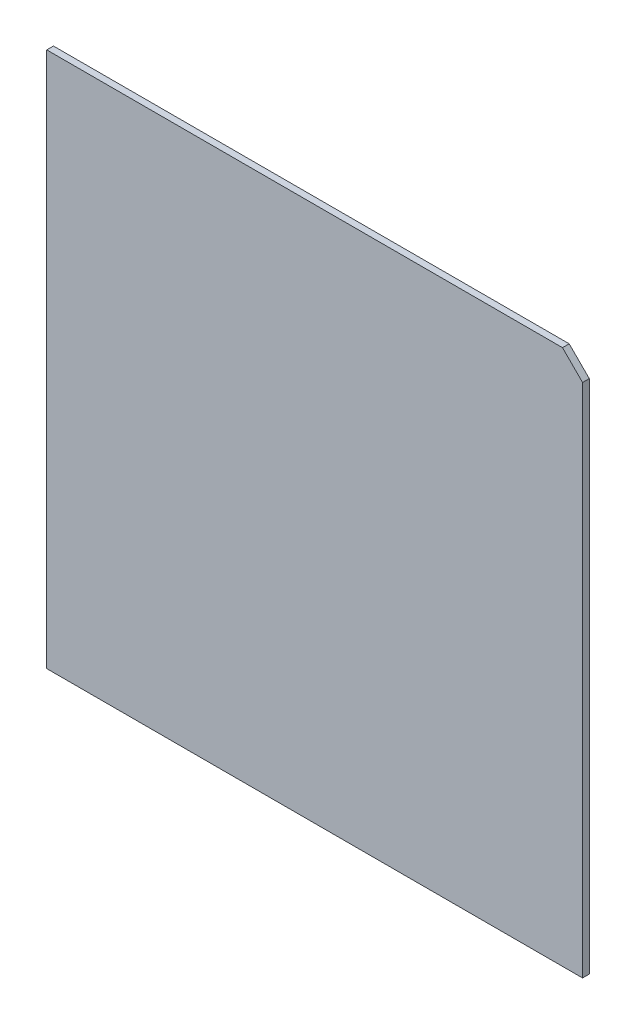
ISO-10303-21;
HEADER;
FILE_DESCRIPTION(('STEP AP214'),'2;1');
FILE_NAME('part.step','',(''),(''),'','','');
FILE_SCHEMA(('AUTOMOTIVE_DESIGN { 1 0 10303 214 1 1 1 1 }'));
ENDSEC;
DATA;
#1=APPLICATION_CONTEXT('core data for automotive mechanical design processes');
#2=APPLICATION_PROTOCOL_DEFINITION('international standard','automotive_design',2000,#1);
#3=PRODUCT_CONTEXT('',#1,'mechanical');
#4=PRODUCT('Part','Part','',(#3));
#5=PRODUCT_RELATED_PRODUCT_CATEGORY('part','',(#4));
#6=PRODUCT_DEFINITION_FORMATION('','',#4);
#7=PRODUCT_DEFINITION_CONTEXT('part definition',#1,'design');
#8=PRODUCT_DEFINITION('design','',#6,#7);
#9=PRODUCT_DEFINITION_SHAPE('','',#8);
#10=(LENGTH_UNIT() NAMED_UNIT(*) SI_UNIT(.MILLI.,.METRE.));
#11=(NAMED_UNIT(*) PLANE_ANGLE_UNIT() SI_UNIT($,.RADIAN.));
#12=(NAMED_UNIT(*) SI_UNIT($,.STERADIAN.) SOLID_ANGLE_UNIT());
#13=UNCERTAINTY_MEASURE_WITH_UNIT(LENGTH_MEASURE(1.E-05),#10,'distance_accuracy_value','');
#14=(GEOMETRIC_REPRESENTATION_CONTEXT(3) GLOBAL_UNCERTAINTY_ASSIGNED_CONTEXT((#13)) GLOBAL_UNIT_ASSIGNED_CONTEXT((#10,
#11,#12)) REPRESENTATION_CONTEXT('',''));
#15=CARTESIAN_POINT('',(0.,0.,0.));
#16=DIRECTION('',(0.,0.,1.));
#17=DIRECTION('',(1.,0.,0.));
#18=AXIS2_PLACEMENT_3D('',#15,#16,#17);
#19=CARTESIAN_POINT('',(-1000.,1000.,25.));
#20=DIRECTION('',(1.,0.,0.));
#21=DIRECTION('',(0.,1.,0.));
#22=AXIS2_PLACEMENT_3D('',#19,#20,#21);
#23=PLANE('',#22);
#24=DIRECTION('',(0.,-1.,0.));
#25=VECTOR('',#24,1.);
#26=CARTESIAN_POINT('',(-1000.,1000.,0.));
#27=LINE('',#26,#25);
#28=CARTESIAN_POINT('',(-1000.,1000.,0.));
#29=VERTEX_POINT('',#28);
#30=CARTESIAN_POINT('',(-1000.,-1000.,0.));
#31=VERTEX_POINT('',#30);
#32=EDGE_CURVE('E108',#29,#31,#27,.T.);
#33=ORIENTED_EDGE('',*,*,#32,.T.);
#34=DIRECTION('',(0.,0.,-1.));
#35=VECTOR('',#34,1.);
#36=CARTESIAN_POINT('',(-1000.,-1000.,25.));
#37=LINE('',#36,#35);
#38=CARTESIAN_POINT('',(-1000.,-1000.,25.));
#39=VERTEX_POINT('',#38);
#40=EDGE_CURVE('E11',#39,#31,#37,.T.);
#41=ORIENTED_EDGE('',*,*,#40,.F.);
#42=DIRECTION('',(0.,-1.,0.));
#43=VECTOR('',#42,1.);
#44=CARTESIAN_POINT('',(-1000.,1000.,25.));
#45=LINE('',#44,#43);
#46=CARTESIAN_POINT('',(-1000.,1000.,25.));
#47=VERTEX_POINT('',#46);
#48=EDGE_CURVE('E110',#47,#39,#45,.T.);
#49=ORIENTED_EDGE('',*,*,#48,.F.);
#50=DIRECTION('',(0.,0.,-1.));
#51=VECTOR('',#50,1.);
#52=CARTESIAN_POINT('',(-1000.,1000.,25.));
#53=LINE('',#52,#51);
#54=EDGE_CURVE('E120',#47,#29,#53,.T.);
#55=ORIENTED_EDGE('',*,*,#54,.T.);
#56=EDGE_LOOP('',(#33,#41,#49,#55));
#57=FACE_BOUND('',#56,.T.);
#58=ADVANCED_FACE('F39',(#57),#23,.F.);
#59=CARTESIAN_POINT('',(-1000.,-1000.,25.));
#60=DIRECTION('',(0.,1.,0.));
#61=DIRECTION('',(-1.,0.,0.));
#62=AXIS2_PLACEMENT_3D('',#59,#60,#61);
#63=PLANE('',#62);
#64=DIRECTION('',(1.,0.,0.));
#65=VECTOR('',#64,1.);
#66=CARTESIAN_POINT('',(-1000.,-1000.,0.));
#67=LINE('',#66,#65);
#68=CARTESIAN_POINT('',(1000.,-1000.,0.));
#69=VERTEX_POINT('',#68);
#70=EDGE_CURVE('E116',#31,#69,#67,.T.);
#71=ORIENTED_EDGE('',*,*,#70,.T.);
#72=DIRECTION('',(0.,0.,-1.));
#73=VECTOR('',#72,1.);
#74=CARTESIAN_POINT('',(1000.,-1000.,25.));
#75=LINE('',#74,#73);
#76=CARTESIAN_POINT('',(1000.,-1000.,25.));
#77=VERTEX_POINT('',#76);
#78=EDGE_CURVE('E47',#77,#69,#75,.T.);
#79=ORIENTED_EDGE('',*,*,#78,.F.);
#80=DIRECTION('',(1.,0.,0.));
#81=VECTOR('',#80,1.);
#82=CARTESIAN_POINT('',(-1000.,-1000.,25.));
#83=LINE('',#82,#81);
#84=EDGE_CURVE('E86',#39,#77,#83,.T.);
#85=ORIENTED_EDGE('',*,*,#84,.F.);
#86=ORIENTED_EDGE('',*,*,#40,.T.);
#87=EDGE_LOOP('',(#71,#79,#85,#86));
#88=FACE_BOUND('',#87,.T.);
#89=ADVANCED_FACE('F131',(#88),#63,.F.);
#90=CARTESIAN_POINT('',(1000.,1000.,25.));
#91=DIRECTION('',(-1.,0.,0.));
#92=DIRECTION('',(0.,-1.,0.));
#93=AXIS2_PLACEMENT_3D('',#90,#91,#92);
#94=PLANE('',#93);
#95=DIRECTION('',(0.,1.,0.));
#96=VECTOR('',#95,1.);
#97=CARTESIAN_POINT('',(1000.,1000.,0.));
#98=LINE('',#97,#96);
#99=CARTESIAN_POINT('',(1000.,925.,0.));
#100=VERTEX_POINT('',#99);
#101=EDGE_CURVE('E111',#69,#100,#98,.T.);
#102=ORIENTED_EDGE('',*,*,#101,.T.);
#103=DIRECTION('',(0.,0.,1.));
#104=VECTOR('',#103,1.);
#105=CARTESIAN_POINT('',(1000.,925.,0.));
#106=LINE('',#105,#104);
#107=CARTESIAN_POINT('',(1000.,925.,25.));
#108=VERTEX_POINT('',#107);
#109=EDGE_CURVE('E54',#100,#108,#106,.T.);
#110=ORIENTED_EDGE('',*,*,#109,.T.);
#111=DIRECTION('',(0.,1.,0.));
#112=VECTOR('',#111,1.);
#113=CARTESIAN_POINT('',(1000.,1000.,25.));
#114=LINE('',#113,#112);
#115=EDGE_CURVE('E128',#77,#108,#114,.T.);
#116=ORIENTED_EDGE('',*,*,#115,.F.);
#117=ORIENTED_EDGE('',*,*,#78,.T.);
#118=EDGE_LOOP('',(#102,#110,#116,#117));
#119=FACE_BOUND('',#118,.T.);
#120=ADVANCED_FACE('F126',(#119),#94,.F.);
#121=CARTESIAN_POINT('',(-1000.,1000.,25.));
#122=DIRECTION('',(0.,-1.,0.));
#123=DIRECTION('',(0.,0.,-1.));
#124=AXIS2_PLACEMENT_3D('',#121,#122,#123);
#125=PLANE('',#124);
#126=DIRECTION('',(-1.,0.,0.));
#127=VECTOR('',#126,1.);
#128=CARTESIAN_POINT('',(-1000.,1000.,25.));
#129=LINE('',#128,#127);
#130=CARTESIAN_POINT('',(925.,1000.,25.));
#131=VERTEX_POINT('',#130);
#132=EDGE_CURVE('E63',#131,#47,#129,.T.);
#133=ORIENTED_EDGE('',*,*,#132,.F.);
#134=DIRECTION('',(0.,0.,1.));
#135=VECTOR('',#134,1.);
#136=CARTESIAN_POINT('',(925.,1000.,0.));
#137=LINE('',#136,#135);
#138=CARTESIAN_POINT('',(925.,1000.,0.));
#139=VERTEX_POINT('',#138);
#140=EDGE_CURVE('E95',#139,#131,#137,.T.);
#141=ORIENTED_EDGE('',*,*,#140,.F.);
#142=DIRECTION('',(-1.,0.,0.));
#143=VECTOR('',#142,1.);
#144=CARTESIAN_POINT('',(-1000.,1000.,0.));
#145=LINE('',#144,#143);
#146=EDGE_CURVE('E81',#139,#29,#145,.T.);
#147=ORIENTED_EDGE('',*,*,#146,.T.);
#148=ORIENTED_EDGE('',*,*,#54,.F.);
#149=EDGE_LOOP('',(#133,#141,#147,#148));
#150=FACE_BOUND('',#149,.T.);
#151=ADVANCED_FACE('F102',(#150),#125,.F.);
#152=CARTESIAN_POINT('',(0.,0.,25.));
#153=DIRECTION('',(0.,0.,1.));
#154=DIRECTION('',(1.,0.,0.));
#155=AXIS2_PLACEMENT_3D('',#152,#153,#154);
#156=PLANE('',#155);
#157=DIRECTION('',(0.707106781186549,-0.707106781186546,0.));
#158=VECTOR('',#157,1.);
#159=CARTESIAN_POINT('',(925.,1000.,25.));
#160=LINE('',#159,#158);
#161=EDGE_CURVE('E100',#131,#108,#160,.T.);
#162=ORIENTED_EDGE('',*,*,#161,.F.);
#163=ORIENTED_EDGE('',*,*,#132,.T.);
#164=ORIENTED_EDGE('',*,*,#48,.T.);
#165=ORIENTED_EDGE('',*,*,#84,.T.);
#166=ORIENTED_EDGE('',*,*,#115,.T.);
#167=EDGE_LOOP('',(#162,#163,#164,#165,#166));
#168=FACE_BOUND('',#167,.T.);
#169=ADVANCED_FACE('F146',(#168),#156,.T.);
#170=CARTESIAN_POINT('',(0.,0.,0.));
#171=DIRECTION('',(0.,0.,1.));
#172=DIRECTION('',(1.,0.,0.));
#173=AXIS2_PLACEMENT_3D('',#170,#171,#172);
#174=PLANE('',#173);
#175=ORIENTED_EDGE('',*,*,#146,.F.);
#176=DIRECTION('',(0.707106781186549,-0.707106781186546,0.));
#177=VECTOR('',#176,1.);
#178=CARTESIAN_POINT('',(925.,1000.,0.));
#179=LINE('',#178,#177);
#180=EDGE_CURVE('E93',#139,#100,#179,.T.);
#181=ORIENTED_EDGE('',*,*,#180,.T.);
#182=ORIENTED_EDGE('',*,*,#101,.F.);
#183=ORIENTED_EDGE('',*,*,#70,.F.);
#184=ORIENTED_EDGE('',*,*,#32,.F.);
#185=EDGE_LOOP('',(#175,#181,#182,#183,#184));
#186=FACE_BOUND('',#185,.T.);
#187=ADVANCED_FACE('F106',(#186),#174,.F.);
#188=CARTESIAN_POINT('',(925.,1000.,0.));
#189=DIRECTION('',(-0.707106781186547,-0.707106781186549,0.));
#190=DIRECTION('',(0.707106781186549,-0.707106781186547,0.));
#191=AXIS2_PLACEMENT_3D('',#188,#189,#190);
#192=PLANE('',#191);
#193=ORIENTED_EDGE('',*,*,#161,.T.);
#194=ORIENTED_EDGE('',*,*,#109,.F.);
#195=ORIENTED_EDGE('',*,*,#180,.F.);
#196=ORIENTED_EDGE('',*,*,#140,.T.);
#197=EDGE_LOOP('',(#193,#194,#195,#196));
#198=FACE_BOUND('',#197,.T.);
#199=ADVANCED_FACE('F94',(#198),#192,.F.);
#200=CLOSED_SHELL('',(#58,#89,#120,#151,#169,#187,#199));
#201=MANIFOLD_SOLID_BREP('B2',#200);
#202=ADVANCED_BREP_SHAPE_REPRESENTATION('',(#18,#201),#14);
#203=SHAPE_DEFINITION_REPRESENTATION(#9,#202);
ENDSEC;
END-ISO-10303-21;
